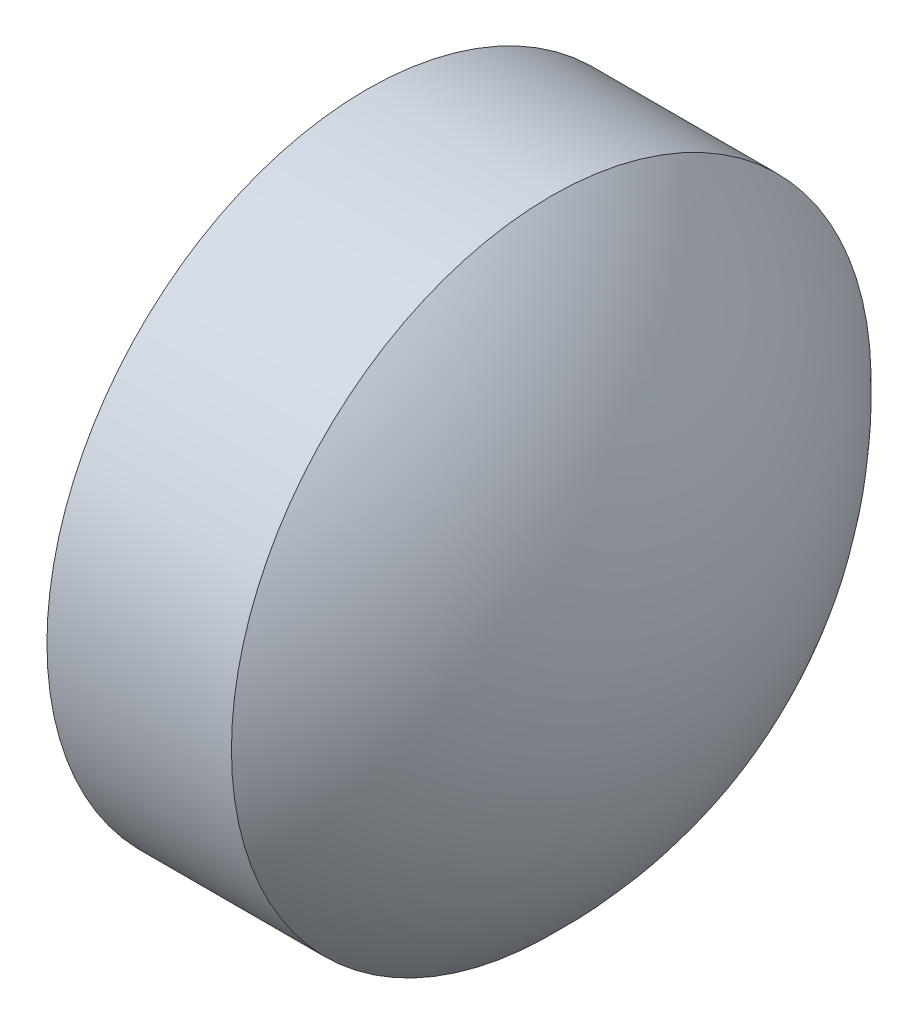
ISO-10303-21;
HEADER;
FILE_DESCRIPTION(('STEP AP214'),'2;1');
FILE_NAME('part.step','',(''),(''),'','','');
FILE_SCHEMA(('AUTOMOTIVE_DESIGN { 1 0 10303 214 1 1 1 1 }'));
ENDSEC;
DATA;
#1=APPLICATION_CONTEXT('core data for automotive mechanical design processes');
#2=APPLICATION_PROTOCOL_DEFINITION('international standard','automotive_design',2000,#1);
#3=PRODUCT_CONTEXT('',#1,'mechanical');
#4=PRODUCT('Part','Part','',(#3));
#5=PRODUCT_RELATED_PRODUCT_CATEGORY('part','',(#4));
#6=PRODUCT_DEFINITION_FORMATION('','',#4);
#7=PRODUCT_DEFINITION_CONTEXT('part definition',#1,'design');
#8=PRODUCT_DEFINITION('design','',#6,#7);
#9=PRODUCT_DEFINITION_SHAPE('','',#8);
#10=(LENGTH_UNIT() NAMED_UNIT(*) SI_UNIT(.MILLI.,.METRE.));
#11=(NAMED_UNIT(*) PLANE_ANGLE_UNIT() SI_UNIT($,.RADIAN.));
#12=(NAMED_UNIT(*) SI_UNIT($,.STERADIAN.) SOLID_ANGLE_UNIT());
#13=UNCERTAINTY_MEASURE_WITH_UNIT(LENGTH_MEASURE(1.E-05),#10,'distance_accuracy_value','');
#14=(GEOMETRIC_REPRESENTATION_CONTEXT(3) GLOBAL_UNCERTAINTY_ASSIGNED_CONTEXT((#13)) GLOBAL_UNIT_ASSIGNED_CONTEXT((#10,
#11,#12)) REPRESENTATION_CONTEXT('',''));
#15=CARTESIAN_POINT('',(0.,0.,0.));
#16=DIRECTION('',(0.,0.,1.));
#17=DIRECTION('',(1.,0.,0.));
#18=AXIS2_PLACEMENT_3D('',#15,#16,#17);
#19=CARTESIAN_POINT('',(45.3835,0.,8.));
#20=DIRECTION('',(-1.,0.,0.));
#21=DIRECTION('',(0.,1.,0.));
#22=AXIS2_PLACEMENT_3D('',#19,#20,#21);
#23=SPHERICAL_SURFACE('',#22,3.3385);
#24=CARTESIAN_POINT('',(42.5404238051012,0.,8.));
#25=DIRECTION('',(-1.,0.,0.));
#26=DIRECTION('',(0.,0.,1.));
#27=AXIS2_PLACEMENT_3D('',#24,#25,#26);
#28=CIRCLE('',#27,1.75);
#29=CARTESIAN_POINT('',(42.5404238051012,0.,9.75));
#30=VERTEX_POINT('',#29);
#31=EDGE_CURVE('E36',#30,#30,#28,.T.);
#32=ORIENTED_EDGE('',*,*,#31,.T.);
#33=EDGE_LOOP('',(#32));
#34=FACE_BOUND('',#33,.T.);
#35=ADVANCED_FACE('F30',(#34),#23,.T.);
#36=CARTESIAN_POINT('',(41.8993,0.,8.));
#37=DIRECTION('',(-1.,0.,0.));
#38=DIRECTION('',(0.,1.,0.));
#39=AXIS2_PLACEMENT_3D('',#36,#37,#38);
#40=SPHERICAL_SURFACE('',#39,2.4057);
#41=CARTESIAN_POINT('',(43.5500248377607,0.,8.));
#42=DIRECTION('',(-1.,0.,0.));
#43=DIRECTION('',(0.,0.,1.));
#44=AXIS2_PLACEMENT_3D('',#41,#42,#43);
#45=CIRCLE('',#44,1.75);
#46=CARTESIAN_POINT('',(43.5500248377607,0.,9.75));
#47=VERTEX_POINT('',#46);
#48=EDGE_CURVE('E10',#47,#47,#45,.T.);
#49=ORIENTED_EDGE('',*,*,#48,.F.);
#50=EDGE_LOOP('',(#49));
#51=FACE_BOUND('',#50,.T.);
#52=ADVANCED_FACE('F45',(#51),#40,.T.);
#53=CARTESIAN_POINT('',(0.,0.,8.));
#54=DIRECTION('',(-1.,0.,0.));
#55=DIRECTION('',(0.,0.,1.));
#56=AXIS2_PLACEMENT_3D('',#53,#54,#55);
#57=CYLINDRICAL_SURFACE('',#56,1.75);
#58=ORIENTED_EDGE('',*,*,#31,.F.);
#59=EDGE_LOOP('',(#58));
#60=FACE_BOUND('',#59,.T.);
#61=ORIENTED_EDGE('',*,*,#48,.T.);
#62=EDGE_LOOP('',(#61));
#63=FACE_BOUND('',#62,.T.);
#64=ADVANCED_FACE('F43',(#60,#63),#57,.T.);
#65=CLOSED_SHELL('',(#35,#52,#64));
#66=MANIFOLD_SOLID_BREP('B2',#65);
#67=ADVANCED_BREP_SHAPE_REPRESENTATION('',(#18,#66),#14);
#68=SHAPE_DEFINITION_REPRESENTATION(#9,#67);
ENDSEC;
END-ISO-10303-21;
